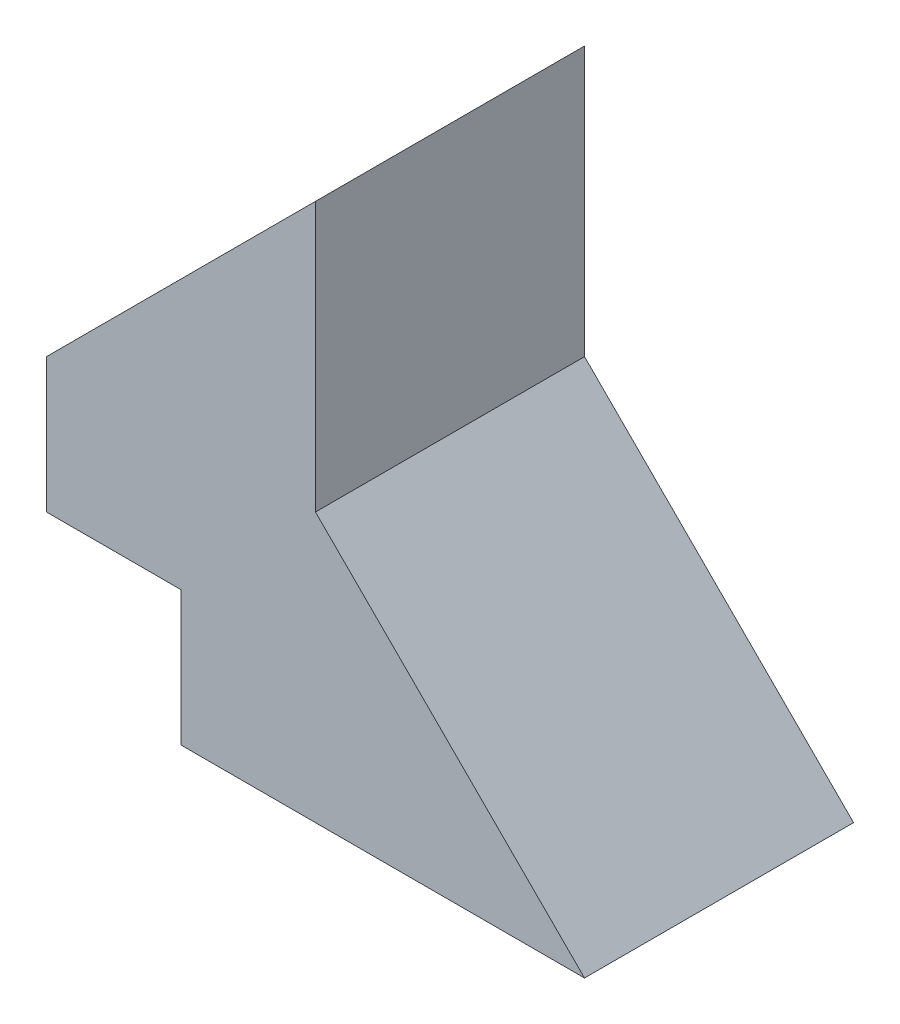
ISO-10303-21;
HEADER;
FILE_DESCRIPTION(('STEP AP214'),'2;1');
FILE_NAME('part.step','',(''),(''),'','','');
FILE_SCHEMA(('AUTOMOTIVE_DESIGN { 1 0 10303 214 1 1 1 1 }'));
ENDSEC;
DATA;
#1=APPLICATION_CONTEXT('core data for automotive mechanical design processes');
#2=APPLICATION_PROTOCOL_DEFINITION('international standard','automotive_design',2000,#1);
#3=PRODUCT_CONTEXT('',#1,'mechanical');
#4=PRODUCT('Part','Part','',(#3));
#5=PRODUCT_RELATED_PRODUCT_CATEGORY('part','',(#4));
#6=PRODUCT_DEFINITION_FORMATION('','',#4);
#7=PRODUCT_DEFINITION_CONTEXT('part definition',#1,'design');
#8=PRODUCT_DEFINITION('design','',#6,#7);
#9=PRODUCT_DEFINITION_SHAPE('','',#8);
#10=(LENGTH_UNIT() NAMED_UNIT(*) SI_UNIT(.MILLI.,.METRE.));
#11=(NAMED_UNIT(*) PLANE_ANGLE_UNIT() SI_UNIT($,.RADIAN.));
#12=(NAMED_UNIT(*) SI_UNIT($,.STERADIAN.) SOLID_ANGLE_UNIT());
#13=UNCERTAINTY_MEASURE_WITH_UNIT(LENGTH_MEASURE(1.E-05),#10,'distance_accuracy_value','');
#14=(GEOMETRIC_REPRESENTATION_CONTEXT(3) GLOBAL_UNCERTAINTY_ASSIGNED_CONTEXT((#13)) GLOBAL_UNIT_ASSIGNED_CONTEXT((#10,
#11,#12)) REPRESENTATION_CONTEXT('',''));
#15=CARTESIAN_POINT('',(0.,0.,0.));
#16=DIRECTION('',(0.,0.,1.));
#17=DIRECTION('',(1.,0.,0.));
#18=AXIS2_PLACEMENT_3D('',#15,#16,#17);
#19=CARTESIAN_POINT('',(5.,0.,10.));
#20=DIRECTION('',(-1.,0.,0.));
#21=DIRECTION('',(0.,0.,1.));
#22=AXIS2_PLACEMENT_3D('',#19,#20,#21);
#23=PLANE('',#22);
#24=DIRECTION('',(0.,1.,0.));
#25=VECTOR('',#24,1.);
#26=CARTESIAN_POINT('',(5.,0.,0.));
#27=LINE('',#26,#25);
#28=CARTESIAN_POINT('',(5.,0.,0.));
#29=VERTEX_POINT('',#28);
#30=CARTESIAN_POINT('',(5.,5.,0.));
#31=VERTEX_POINT('',#30);
#32=EDGE_CURVE('E100',#29,#31,#27,.T.);
#33=ORIENTED_EDGE('',*,*,#32,.F.);
#34=DIRECTION('',(0.,0.,-1.));
#35=VECTOR('',#34,1.);
#36=CARTESIAN_POINT('',(5.,0.,10.));
#37=LINE('',#36,#35);
#38=CARTESIAN_POINT('',(5.,0.,10.));
#39=VERTEX_POINT('',#38);
#40=EDGE_CURVE('E96',#39,#29,#37,.T.);
#41=ORIENTED_EDGE('',*,*,#40,.F.);
#42=DIRECTION('',(0.,1.,0.));
#43=VECTOR('',#42,1.);
#44=CARTESIAN_POINT('',(5.,0.,10.));
#45=LINE('',#44,#43);
#46=CARTESIAN_POINT('',(5.,5.,10.));
#47=VERTEX_POINT('',#46);
#48=EDGE_CURVE('E98',#39,#47,#45,.T.);
#49=ORIENTED_EDGE('',*,*,#48,.T.);
#50=DIRECTION('',(0.,0.,-1.));
#51=VECTOR('',#50,1.);
#52=CARTESIAN_POINT('',(5.,5.,10.));
#53=LINE('',#52,#51);
#54=EDGE_CURVE('E127',#47,#31,#53,.T.);
#55=ORIENTED_EDGE('',*,*,#54,.T.);
#56=EDGE_LOOP('',(#33,#41,#49,#55));
#57=FACE_BOUND('',#56,.T.);
#58=ADVANCED_FACE('F35',(#57),#23,.T.);
#59=CARTESIAN_POINT('',(0.,0.,10.));
#60=DIRECTION('',(0.,-1.,0.));
#61=DIRECTION('',(1.,0.,0.));
#62=AXIS2_PLACEMENT_3D('',#59,#60,#61);
#63=PLANE('',#62);
#64=DIRECTION('',(-1.,0.,0.));
#65=VECTOR('',#64,1.);
#66=CARTESIAN_POINT('',(0.,0.,0.));
#67=LINE('',#66,#65);
#68=CARTESIAN_POINT('',(20.,0.,0.));
#69=VERTEX_POINT('',#68);
#70=EDGE_CURVE('E129',#69,#29,#67,.T.);
#71=ORIENTED_EDGE('',*,*,#70,.F.);
#72=DIRECTION('',(0.,0.,-1.));
#73=VECTOR('',#72,1.);
#74=CARTESIAN_POINT('',(20.,0.,10.));
#75=LINE('',#74,#73);
#76=CARTESIAN_POINT('',(20.,0.,10.));
#77=VERTEX_POINT('',#76);
#78=EDGE_CURVE('E106',#77,#69,#75,.T.);
#79=ORIENTED_EDGE('',*,*,#78,.F.);
#80=DIRECTION('',(-1.,0.,0.));
#81=VECTOR('',#80,1.);
#82=CARTESIAN_POINT('',(0.,0.,10.));
#83=LINE('',#82,#81);
#84=EDGE_CURVE('E110',#77,#39,#83,.T.);
#85=ORIENTED_EDGE('',*,*,#84,.T.);
#86=ORIENTED_EDGE('',*,*,#40,.T.);
#87=EDGE_LOOP('',(#71,#79,#85,#86));
#88=FACE_BOUND('',#87,.T.);
#89=ADVANCED_FACE('F117',(#88),#63,.T.);
#90=CARTESIAN_POINT('',(10.,0.,10.));
#91=DIRECTION('',(1.,0.,0.));
#92=DIRECTION('',(0.,0.,-1.));
#93=AXIS2_PLACEMENT_3D('',#90,#91,#92);
#94=PLANE('',#93);
#95=DIRECTION('',(0.,-1.,0.));
#96=VECTOR('',#95,1.);
#97=CARTESIAN_POINT('',(10.,0.,0.));
#98=LINE('',#97,#96);
#99=CARTESIAN_POINT('',(10.,20.,0.));
#100=VERTEX_POINT('',#99);
#101=CARTESIAN_POINT('',(10.,10.,0.));
#102=VERTEX_POINT('',#101);
#103=EDGE_CURVE('E131',#100,#102,#98,.T.);
#104=ORIENTED_EDGE('',*,*,#103,.F.);
#105=DIRECTION('',(0.,0.,-1.));
#106=VECTOR('',#105,1.);
#107=CARTESIAN_POINT('',(10.,20.,10.));
#108=LINE('',#107,#106);
#109=CARTESIAN_POINT('',(10.,20.,10.));
#110=VERTEX_POINT('',#109);
#111=EDGE_CURVE('E142',#110,#100,#108,.T.);
#112=ORIENTED_EDGE('',*,*,#111,.F.);
#113=DIRECTION('',(0.,-1.,0.));
#114=VECTOR('',#113,1.);
#115=CARTESIAN_POINT('',(10.,0.,10.));
#116=LINE('',#115,#114);
#117=CARTESIAN_POINT('',(10.,10.,10.));
#118=VERTEX_POINT('',#117);
#119=EDGE_CURVE('E119',#110,#118,#116,.T.);
#120=ORIENTED_EDGE('',*,*,#119,.T.);
#121=DIRECTION('',(0.,0.,-1.));
#122=VECTOR('',#121,1.);
#123=CARTESIAN_POINT('',(10.,10.,10.));
#124=LINE('',#123,#122);
#125=EDGE_CURVE('E144',#118,#102,#124,.T.);
#126=ORIENTED_EDGE('',*,*,#125,.T.);
#127=EDGE_LOOP('',(#104,#112,#120,#126));
#128=FACE_BOUND('',#127,.T.);
#129=ADVANCED_FACE('F156',(#128),#94,.T.);
#130=CARTESIAN_POINT('',(0.,0.,10.));
#131=DIRECTION('',(-1.,0.,0.));
#132=DIRECTION('',(0.,0.,1.));
#133=AXIS2_PLACEMENT_3D('',#130,#131,#132);
#134=PLANE('',#133);
#135=DIRECTION('',(0.,1.,0.));
#136=VECTOR('',#135,1.);
#137=CARTESIAN_POINT('',(0.,0.,10.));
#138=LINE('',#137,#136);
#139=CARTESIAN_POINT('',(0.,5.,10.));
#140=VERTEX_POINT('',#139);
#141=CARTESIAN_POINT('',(0.,10.,10.));
#142=VERTEX_POINT('',#141);
#143=EDGE_CURVE('E122',#140,#142,#138,.T.);
#144=ORIENTED_EDGE('',*,*,#143,.T.);
#145=DIRECTION('',(0.,0.,-1.));
#146=VECTOR('',#145,1.);
#147=CARTESIAN_POINT('',(0.,10.,10.));
#148=LINE('',#147,#146);
#149=CARTESIAN_POINT('',(0.,10.,0.));
#150=VERTEX_POINT('',#149);
#151=EDGE_CURVE('E105',#142,#150,#148,.T.);
#152=ORIENTED_EDGE('',*,*,#151,.T.);
#153=DIRECTION('',(0.,1.,0.));
#154=VECTOR('',#153,1.);
#155=CARTESIAN_POINT('',(0.,0.,0.));
#156=LINE('',#155,#154);
#157=CARTESIAN_POINT('',(0.,5.,0.));
#158=VERTEX_POINT('',#157);
#159=EDGE_CURVE('E134',#158,#150,#156,.T.);
#160=ORIENTED_EDGE('',*,*,#159,.F.);
#161=DIRECTION('',(0.,0.,-1.));
#162=VECTOR('',#161,1.);
#163=CARTESIAN_POINT('',(0.,5.,10.));
#164=LINE('',#163,#162);
#165=EDGE_CURVE('E140',#140,#158,#164,.T.);
#166=ORIENTED_EDGE('',*,*,#165,.F.);
#167=EDGE_LOOP('',(#144,#152,#160,#166));
#168=FACE_BOUND('',#167,.T.);
#169=ADVANCED_FACE('F160',(#168),#134,.T.);
#170=CARTESIAN_POINT('',(0.,5.,10.));
#171=DIRECTION('',(0.,1.,0.));
#172=DIRECTION('',(0.,0.,1.));
#173=AXIS2_PLACEMENT_3D('',#170,#171,#172);
#174=PLANE('',#173);
#175=DIRECTION('',(1.,0.,0.));
#176=VECTOR('',#175,1.);
#177=CARTESIAN_POINT('',(0.,5.,0.));
#178=LINE('',#177,#176);
#179=EDGE_CURVE('E115',#158,#31,#178,.T.);
#180=ORIENTED_EDGE('',*,*,#179,.T.);
#181=ORIENTED_EDGE('',*,*,#54,.F.);
#182=DIRECTION('',(1.,0.,0.));
#183=VECTOR('',#182,1.);
#184=CARTESIAN_POINT('',(0.,5.,10.));
#185=LINE('',#184,#183);
#186=EDGE_CURVE('E113',#140,#47,#185,.T.);
#187=ORIENTED_EDGE('',*,*,#186,.F.);
#188=ORIENTED_EDGE('',*,*,#165,.T.);
#189=EDGE_LOOP('',(#180,#181,#187,#188));
#190=FACE_BOUND('',#189,.T.);
#191=ADVANCED_FACE('F163',(#190),#174,.F.);
#192=CARTESIAN_POINT('',(0.,0.,10.));
#193=DIRECTION('',(0.,0.,1.));
#194=DIRECTION('',(1.,0.,0.));
#195=AXIS2_PLACEMENT_3D('',#192,#193,#194);
#196=PLANE('',#195);
#197=ORIENTED_EDGE('',*,*,#84,.F.);
#198=DIRECTION('',(0.707106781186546,-0.707106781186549,0.));
#199=VECTOR('',#198,1.);
#200=CARTESIAN_POINT('',(10.,9.99999999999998,10.));
#201=LINE('',#200,#199);
#202=EDGE_CURVE('E11',#77,#118,#201,.F.);
#203=ORIENTED_EDGE('',*,*,#202,.T.);
#204=ORIENTED_EDGE('',*,*,#119,.F.);
#205=DIRECTION('',(0.707106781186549,0.707106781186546,0.));
#206=VECTOR('',#205,1.);
#207=CARTESIAN_POINT('',(-5.,5.00000000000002,10.));
#208=LINE('',#207,#206);
#209=EDGE_CURVE('E50',#110,#142,#208,.F.);
#210=ORIENTED_EDGE('',*,*,#209,.T.);
#211=ORIENTED_EDGE('',*,*,#143,.F.);
#212=ORIENTED_EDGE('',*,*,#186,.T.);
#213=ORIENTED_EDGE('',*,*,#48,.F.);
#214=EDGE_LOOP('',(#197,#203,#204,#210,#211,#212,#213));
#215=FACE_BOUND('',#214,.T.);
#216=ADVANCED_FACE('F109',(#215),#196,.T.);
#217=CARTESIAN_POINT('',(0.,0.,0.));
#218=DIRECTION('',(0.,0.,1.));
#219=DIRECTION('',(1.,0.,0.));
#220=AXIS2_PLACEMENT_3D('',#217,#218,#219);
#221=PLANE('',#220);
#222=ORIENTED_EDGE('',*,*,#103,.T.);
#223=DIRECTION('',(-0.707106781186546,0.707106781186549,0.));
#224=VECTOR('',#223,1.);
#225=CARTESIAN_POINT('',(10.,10.,0.));
#226=LINE('',#225,#224);
#227=EDGE_CURVE('E43',#102,#69,#226,.F.);
#228=ORIENTED_EDGE('',*,*,#227,.T.);
#229=ORIENTED_EDGE('',*,*,#70,.T.);
#230=ORIENTED_EDGE('',*,*,#32,.T.);
#231=ORIENTED_EDGE('',*,*,#179,.F.);
#232=ORIENTED_EDGE('',*,*,#159,.T.);
#233=DIRECTION('',(-0.707106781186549,-0.707106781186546,0.));
#234=VECTOR('',#233,1.);
#235=CARTESIAN_POINT('',(0.,10.,0.));
#236=LINE('',#235,#234);
#237=EDGE_CURVE('E58',#150,#100,#236,.F.);
#238=ORIENTED_EDGE('',*,*,#237,.T.);
#239=EDGE_LOOP('',(#222,#228,#229,#230,#231,#232,#238));
#240=FACE_BOUND('',#239,.T.);
#241=ADVANCED_FACE('F151',(#240),#221,.F.);
#242=CARTESIAN_POINT('',(0.,10.,10.));
#243=DIRECTION('',(0.707106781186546,-0.707106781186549,0.));
#244=DIRECTION('',(0.,0.,-1.));
#245=AXIS2_PLACEMENT_3D('',#242,#243,#244);
#246=PLANE('',#245);
#247=ORIENTED_EDGE('',*,*,#209,.F.);
#248=ORIENTED_EDGE('',*,*,#111,.T.);
#249=ORIENTED_EDGE('',*,*,#237,.F.);
#250=ORIENTED_EDGE('',*,*,#151,.F.);
#251=EDGE_LOOP('',(#247,#248,#249,#250));
#252=FACE_BOUND('',#251,.T.);
#253=ADVANCED_FACE('F157',(#252),#246,.F.);
#254=CARTESIAN_POINT('',(10.,10.,10.));
#255=DIRECTION('',(-0.707106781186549,-0.707106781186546,0.));
#256=DIRECTION('',(0.,0.,-1.));
#257=AXIS2_PLACEMENT_3D('',#254,#255,#256);
#258=PLANE('',#257);
#259=ORIENTED_EDGE('',*,*,#202,.F.);
#260=ORIENTED_EDGE('',*,*,#78,.T.);
#261=ORIENTED_EDGE('',*,*,#227,.F.);
#262=ORIENTED_EDGE('',*,*,#125,.F.);
#263=EDGE_LOOP('',(#259,#260,#261,#262));
#264=FACE_BOUND('',#263,.T.);
#265=ADVANCED_FACE('F37',(#264),#258,.F.);
#266=CLOSED_SHELL('',(#58,#89,#129,#169,#191,#216,#241,#253,#265));
#267=MANIFOLD_SOLID_BREP('B2',#266);
#268=ADVANCED_BREP_SHAPE_REPRESENTATION('',(#18,#267),#14);
#269=SHAPE_DEFINITION_REPRESENTATION(#9,#268);
ENDSEC;
END-ISO-10303-21;
